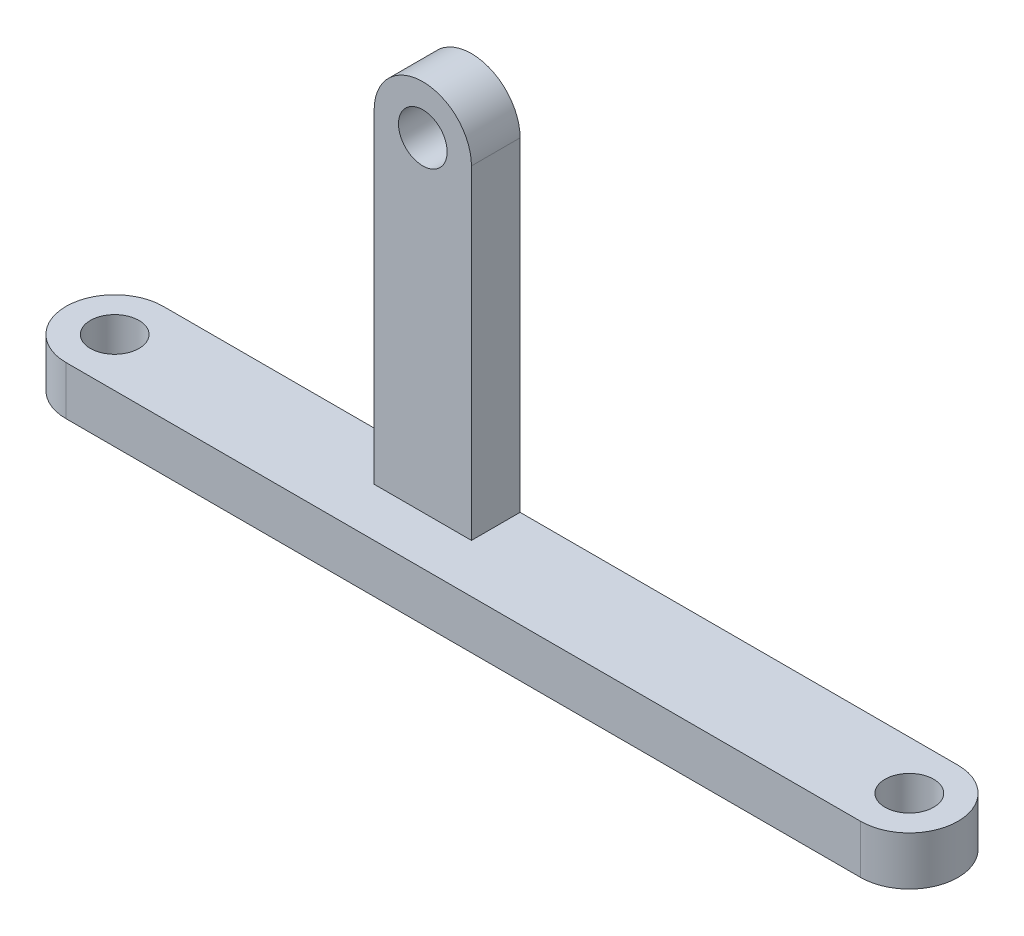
ISO-10303-21;
HEADER;
FILE_DESCRIPTION(('STEP AP214'),'2;1');
FILE_NAME('part.step','',(''),(''),'','','');
FILE_SCHEMA(('AUTOMOTIVE_DESIGN { 1 0 10303 214 1 1 1 1 }'));
ENDSEC;
DATA;
#1=APPLICATION_CONTEXT('core data for automotive mechanical design processes');
#2=APPLICATION_PROTOCOL_DEFINITION('international standard','automotive_design',2000,#1);
#3=PRODUCT_CONTEXT('',#1,'mechanical');
#4=PRODUCT('Part','Part','',(#3));
#5=PRODUCT_RELATED_PRODUCT_CATEGORY('part','',(#4));
#6=PRODUCT_DEFINITION_FORMATION('','',#4);
#7=PRODUCT_DEFINITION_CONTEXT('part definition',#1,'design');
#8=PRODUCT_DEFINITION('design','',#6,#7);
#9=PRODUCT_DEFINITION_SHAPE('','',#8);
#10=(LENGTH_UNIT() NAMED_UNIT(*) SI_UNIT(.MILLI.,.METRE.));
#11=(NAMED_UNIT(*) PLANE_ANGLE_UNIT() SI_UNIT($,.RADIAN.));
#12=(NAMED_UNIT(*) SI_UNIT($,.STERADIAN.) SOLID_ANGLE_UNIT());
#13=UNCERTAINTY_MEASURE_WITH_UNIT(LENGTH_MEASURE(1.E-05),#10,'distance_accuracy_value','');
#14=(GEOMETRIC_REPRESENTATION_CONTEXT(3) GLOBAL_UNCERTAINTY_ASSIGNED_CONTEXT((#13)) GLOBAL_UNIT_ASSIGNED_CONTEXT((#10,
#11,#12)) REPRESENTATION_CONTEXT('',''));
#15=CARTESIAN_POINT('',(0.,0.,0.));
#16=DIRECTION('',(0.,0.,1.));
#17=DIRECTION('',(1.,0.,0.));
#18=AXIS2_PLACEMENT_3D('',#15,#16,#17);
#19=CARTESIAN_POINT('',(-3.,0.,3.));
#20=DIRECTION('',(1.,0.,0.));
#21=DIRECTION('',(0.,1.,0.));
#22=AXIS2_PLACEMENT_3D('',#19,#20,#21);
#23=PLANE('',#22);
#24=DIRECTION('',(0.,-1.,0.));
#25=VECTOR('',#24,1.);
#26=CARTESIAN_POINT('',(-3.,0.,0.));
#27=LINE('',#26,#25);
#28=CARTESIAN_POINT('',(-3.,17.,0.));
#29=VERTEX_POINT('',#28);
#30=CARTESIAN_POINT('',(-3.,-3.,0.));
#31=VERTEX_POINT('',#30);
#32=EDGE_CURVE('E148',#29,#31,#27,.T.);
#33=ORIENTED_EDGE('',*,*,#32,.T.);
#34=DIRECTION('',(0.,0.,-1.));
#35=VECTOR('',#34,1.);
#36=CARTESIAN_POINT('',(-2.99999999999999,-3.,3.));
#37=LINE('',#36,#35);
#38=CARTESIAN_POINT('',(-2.99999999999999,-3.,3.));
#39=VERTEX_POINT('',#38);
#40=EDGE_CURVE('E11',#39,#31,#37,.T.);
#41=ORIENTED_EDGE('',*,*,#40,.F.);
#42=DIRECTION('',(0.,-1.,0.));
#43=VECTOR('',#42,1.);
#44=CARTESIAN_POINT('',(-3.,0.,3.));
#45=LINE('',#44,#43);
#46=CARTESIAN_POINT('',(-3.,17.,3.));
#47=VERTEX_POINT('',#46);
#48=EDGE_CURVE('E81',#47,#39,#45,.T.);
#49=ORIENTED_EDGE('',*,*,#48,.F.);
#50=DIRECTION('',(0.,0.,-1.));
#51=VECTOR('',#50,1.);
#52=CARTESIAN_POINT('',(-3.,17.,3.));
#53=LINE('',#52,#51);
#54=EDGE_CURVE('E168',#47,#29,#53,.T.);
#55=ORIENTED_EDGE('',*,*,#54,.T.);
#56=EDGE_LOOP('',(#33,#41,#49,#55));
#57=FACE_BOUND('',#56,.T.);
#58=ADVANCED_FACE('F41',(#57),#23,.F.);
#59=CARTESIAN_POINT('',(3.,0.,3.));
#60=DIRECTION('',(1.,0.,0.));
#61=DIRECTION('',(0.,1.,0.));
#62=AXIS2_PLACEMENT_3D('',#59,#60,#61);
#63=PLANE('',#62);
#64=DIRECTION('',(0.,-1.,0.));
#65=VECTOR('',#64,1.);
#66=CARTESIAN_POINT('',(3.,0.,0.));
#67=LINE('',#66,#65);
#68=CARTESIAN_POINT('',(3.,17.,0.));
#69=VERTEX_POINT('',#68);
#70=CARTESIAN_POINT('',(3.,-3.,0.));
#71=VERTEX_POINT('',#70);
#72=EDGE_CURVE('E172',#69,#71,#67,.T.);
#73=ORIENTED_EDGE('',*,*,#72,.F.);
#74=DIRECTION('',(0.,0.,-1.));
#75=VECTOR('',#74,1.);
#76=CARTESIAN_POINT('',(3.,17.,3.));
#77=LINE('',#76,#75);
#78=CARTESIAN_POINT('',(3.,17.,3.));
#79=VERTEX_POINT('',#78);
#80=EDGE_CURVE('E73',#79,#69,#77,.T.);
#81=ORIENTED_EDGE('',*,*,#80,.F.);
#82=DIRECTION('',(0.,-1.,0.));
#83=VECTOR('',#82,1.);
#84=CARTESIAN_POINT('',(3.,0.,3.));
#85=LINE('',#84,#83);
#86=CARTESIAN_POINT('',(3.,-3.,3.));
#87=VERTEX_POINT('',#86);
#88=EDGE_CURVE('E163',#79,#87,#85,.T.);
#89=ORIENTED_EDGE('',*,*,#88,.T.);
#90=DIRECTION('',(0.,0.,-1.));
#91=VECTOR('',#90,1.);
#92=CARTESIAN_POINT('',(3.,-3.,3.));
#93=LINE('',#92,#91);
#94=EDGE_CURVE('E51',#87,#71,#93,.T.);
#95=ORIENTED_EDGE('',*,*,#94,.T.);
#96=EDGE_LOOP('',(#73,#81,#89,#95));
#97=FACE_BOUND('',#96,.T.);
#98=ADVANCED_FACE('F185',(#97),#63,.T.);
#99=CARTESIAN_POINT('',(0.,17.,3.));
#100=DIRECTION('',(0.,0.,-1.));
#101=DIRECTION('',(-1.,0.,0.));
#102=AXIS2_PLACEMENT_3D('',#99,#100,#101);
#103=CYLINDRICAL_SURFACE('',#102,1.5);
#104=CARTESIAN_POINT('',(0.,17.,3.));
#105=DIRECTION('',(0.,0.,1.));
#106=DIRECTION('',(1.,0.,0.));
#107=AXIS2_PLACEMENT_3D('',#104,#105,#106);
#108=CIRCLE('',#107,1.5);
#109=CARTESIAN_POINT('',(1.5,17.,3.));
#110=VERTEX_POINT('',#109);
#111=EDGE_CURVE('E154',#110,#110,#108,.T.);
#112=ORIENTED_EDGE('',*,*,#111,.T.);
#113=EDGE_LOOP('',(#112));
#114=FACE_BOUND('',#113,.T.);
#115=CARTESIAN_POINT('',(0.,17.,0.));
#116=DIRECTION('',(0.,0.,1.));
#117=DIRECTION('',(1.,0.,0.));
#118=AXIS2_PLACEMENT_3D('',#115,#116,#117);
#119=CIRCLE('',#118,1.5);
#120=CARTESIAN_POINT('',(1.5,17.,0.));
#121=VERTEX_POINT('',#120);
#122=EDGE_CURVE('E143',#121,#121,#119,.T.);
#123=ORIENTED_EDGE('',*,*,#122,.F.);
#124=EDGE_LOOP('',(#123));
#125=FACE_BOUND('',#124,.T.);
#126=ADVANCED_FACE('F43',(#114,#125),#103,.F.);
#127=CARTESIAN_POINT('',(0.,17.,3.));
#128=DIRECTION('',(0.,0.,-1.));
#129=DIRECTION('',(-1.,0.,0.));
#130=AXIS2_PLACEMENT_3D('',#127,#128,#129);
#131=CYLINDRICAL_SURFACE('',#130,3.);
#132=CARTESIAN_POINT('',(0.,17.,0.));
#133=DIRECTION('',(0.,0.,1.));
#134=DIRECTION('',(1.,0.,0.));
#135=AXIS2_PLACEMENT_3D('',#132,#133,#134);
#136=CIRCLE('',#135,3.);
#137=EDGE_CURVE('E76',#69,#29,#136,.T.);
#138=ORIENTED_EDGE('',*,*,#137,.T.);
#139=ORIENTED_EDGE('',*,*,#54,.F.);
#140=CARTESIAN_POINT('',(0.,17.,3.));
#141=DIRECTION('',(0.,0.,1.));
#142=DIRECTION('',(1.,0.,0.));
#143=AXIS2_PLACEMENT_3D('',#140,#141,#142);
#144=CIRCLE('',#143,3.);
#145=EDGE_CURVE('E59',#79,#47,#144,.T.);
#146=ORIENTED_EDGE('',*,*,#145,.F.);
#147=ORIENTED_EDGE('',*,*,#80,.T.);
#148=EDGE_LOOP('',(#138,#139,#146,#147));
#149=FACE_BOUND('',#148,.T.);
#150=ADVANCED_FACE('F217',(#149),#131,.T.);
#151=CARTESIAN_POINT('',(0.,0.,3.));
#152=DIRECTION('',(0.,0.,1.));
#153=DIRECTION('',(1.,0.,0.));
#154=AXIS2_PLACEMENT_3D('',#151,#152,#153);
#155=PLANE('',#154);
#156=ORIENTED_EDGE('',*,*,#111,.F.);
#157=EDGE_LOOP('',(#156));
#158=FACE_BOUND('',#157,.T.);
#159=ORIENTED_EDGE('',*,*,#48,.T.);
#160=DIRECTION('',(1.,0.,0.));
#161=VECTOR('',#160,1.);
#162=CARTESIAN_POINT('',(0.,-3.,3.));
#163=LINE('',#162,#161);
#164=EDGE_CURVE('E160',#39,#87,#163,.T.);
#165=ORIENTED_EDGE('',*,*,#164,.T.);
#166=ORIENTED_EDGE('',*,*,#88,.F.);
#167=ORIENTED_EDGE('',*,*,#145,.T.);
#168=EDGE_LOOP('',(#159,#165,#166,#167));
#169=FACE_BOUND('',#168,.T.);
#170=ADVANCED_FACE('F218',(#158,#169),#155,.T.);
#171=CARTESIAN_POINT('',(0.,0.,0.));
#172=DIRECTION('',(0.,0.,1.));
#173=DIRECTION('',(1.,0.,0.));
#174=AXIS2_PLACEMENT_3D('',#171,#172,#173);
#175=PLANE('',#174);
#176=ORIENTED_EDGE('',*,*,#122,.T.);
#177=EDGE_LOOP('',(#176));
#178=FACE_BOUND('',#177,.T.);
#179=ORIENTED_EDGE('',*,*,#32,.F.);
#180=ORIENTED_EDGE('',*,*,#137,.F.);
#181=ORIENTED_EDGE('',*,*,#72,.T.);
#182=DIRECTION('',(1.,0.,0.));
#183=VECTOR('',#182,1.);
#184=CARTESIAN_POINT('',(-19.,-3.,0.));
#185=LINE('',#184,#183);
#186=CARTESIAN_POINT('',(30.,-2.99999999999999,0.));
#187=VERTEX_POINT('',#186);
#188=EDGE_CURVE('E189',#71,#187,#185,.T.);
#189=ORIENTED_EDGE('',*,*,#188,.T.);
#190=DIRECTION('',(0.,1.,0.));
#191=VECTOR('',#190,1.);
#192=CARTESIAN_POINT('',(30.,-5.99999999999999,0.));
#193=LINE('',#192,#191);
#194=CARTESIAN_POINT('',(30.,-5.99999999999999,0.));
#195=VERTEX_POINT('',#194);
#196=EDGE_CURVE('E121',#195,#187,#193,.T.);
#197=ORIENTED_EDGE('',*,*,#196,.F.);
#198=DIRECTION('',(1.,0.,0.));
#199=VECTOR('',#198,1.);
#200=CARTESIAN_POINT('',(-19.,-6.,0.));
#201=LINE('',#200,#199);
#202=CARTESIAN_POINT('',(-19.,-6.,0.));
#203=VERTEX_POINT('',#202);
#204=EDGE_CURVE('E112',#203,#195,#201,.T.);
#205=ORIENTED_EDGE('',*,*,#204,.F.);
#206=DIRECTION('',(0.,1.,0.));
#207=VECTOR('',#206,1.);
#208=CARTESIAN_POINT('',(-19.,-6.,0.));
#209=LINE('',#208,#207);
#210=CARTESIAN_POINT('',(-19.,-3.,0.));
#211=VERTEX_POINT('',#210);
#212=EDGE_CURVE('E118',#203,#211,#209,.T.);
#213=ORIENTED_EDGE('',*,*,#212,.T.);
#214=EDGE_CURVE('E196',#211,#31,#185,.T.);
#215=ORIENTED_EDGE('',*,*,#214,.T.);
#216=EDGE_LOOP('',(#179,#180,#181,#189,#197,#205,#213,#215));
#217=FACE_BOUND('',#216,.T.);
#218=ADVANCED_FACE('F115',(#178,#217),#175,.F.);
#219=CARTESIAN_POINT('',(-19.,-6.,3.));
#220=DIRECTION('',(0.,-1.,0.));
#221=DIRECTION('',(1.,0.,0.));
#222=AXIS2_PLACEMENT_3D('',#219,#220,#221);
#223=PLANE('',#222);
#224=CARTESIAN_POINT('',(-19.,-6.,3.));
#225=DIRECTION('',(0.,-1.,0.));
#226=DIRECTION('',(1.,0.,0.));
#227=AXIS2_PLACEMENT_3D('',#224,#225,#226);
#228=CIRCLE('',#227,1.5);
#229=CARTESIAN_POINT('',(-17.5,-6.,3.));
#230=VERTEX_POINT('',#229);
#231=EDGE_CURVE('E200',#230,#230,#228,.T.);
#232=ORIENTED_EDGE('',*,*,#231,.F.);
#233=EDGE_LOOP('',(#232));
#234=FACE_BOUND('',#233,.T.);
#235=CARTESIAN_POINT('',(-19.,-6.,3.));
#236=DIRECTION('',(0.,-1.,0.));
#237=DIRECTION('',(1.,0.,0.));
#238=AXIS2_PLACEMENT_3D('',#235,#236,#237);
#239=CIRCLE('',#238,3.);
#240=CARTESIAN_POINT('',(-19.,-6.,6.));
#241=VERTEX_POINT('',#240);
#242=EDGE_CURVE('E126',#241,#203,#239,.T.);
#243=ORIENTED_EDGE('',*,*,#242,.T.);
#244=ORIENTED_EDGE('',*,*,#204,.T.);
#245=CARTESIAN_POINT('',(30.,-5.99999999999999,3.00000000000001));
#246=DIRECTION('',(0.,-1.,0.));
#247=DIRECTION('',(1.,0.,0.));
#248=AXIS2_PLACEMENT_3D('',#245,#246,#247);
#249=CIRCLE('',#248,3.);
#250=CARTESIAN_POINT('',(30.,-5.99999999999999,6.00000000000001));
#251=VERTEX_POINT('',#250);
#252=EDGE_CURVE('E125',#195,#251,#249,.T.);
#253=ORIENTED_EDGE('',*,*,#252,.T.);
#254=DIRECTION('',(-1.,0.,0.));
#255=VECTOR('',#254,1.);
#256=CARTESIAN_POINT('',(-19.,-6.,6.));
#257=LINE('',#256,#255);
#258=EDGE_CURVE('E132',#251,#241,#257,.T.);
#259=ORIENTED_EDGE('',*,*,#258,.T.);
#260=EDGE_LOOP('',(#243,#244,#253,#259));
#261=FACE_BOUND('',#260,.T.);
#262=CARTESIAN_POINT('',(30.,-5.99999999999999,3.00000000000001));
#263=DIRECTION('',(0.,-1.,0.));
#264=DIRECTION('',(1.,0.,0.));
#265=AXIS2_PLACEMENT_3D('',#262,#263,#264);
#266=CIRCLE('',#265,1.5);
#267=CARTESIAN_POINT('',(31.5,-5.99999999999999,3.00000000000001));
#268=VERTEX_POINT('',#267);
#269=EDGE_CURVE('E340',#268,#268,#266,.T.);
#270=ORIENTED_EDGE('',*,*,#269,.F.);
#271=EDGE_LOOP('',(#270));
#272=FACE_BOUND('',#271,.T.);
#273=ADVANCED_FACE('F129',(#234,#261,#272),#223,.T.);
#274=CARTESIAN_POINT('',(-19.,-3.,3.));
#275=DIRECTION('',(0.,-1.,0.));
#276=DIRECTION('',(1.,0.,0.));
#277=AXIS2_PLACEMENT_3D('',#274,#275,#276);
#278=PLANE('',#277);
#279=ORIENTED_EDGE('',*,*,#94,.F.);
#280=ORIENTED_EDGE('',*,*,#164,.F.);
#281=ORIENTED_EDGE('',*,*,#40,.T.);
#282=ORIENTED_EDGE('',*,*,#214,.F.);
#283=CARTESIAN_POINT('',(-19.,-3.,3.));
#284=DIRECTION('',(0.,-1.,0.));
#285=DIRECTION('',(1.,0.,0.));
#286=AXIS2_PLACEMENT_3D('',#283,#284,#285);
#287=CIRCLE('',#286,3.);
#288=CARTESIAN_POINT('',(-19.,-3.,6.));
#289=VERTEX_POINT('',#288);
#290=EDGE_CURVE('E141',#289,#211,#287,.T.);
#291=ORIENTED_EDGE('',*,*,#290,.F.);
#292=DIRECTION('',(-1.,0.,0.));
#293=VECTOR('',#292,1.);
#294=CARTESIAN_POINT('',(-19.,-3.,6.));
#295=LINE('',#294,#293);
#296=CARTESIAN_POINT('',(30.,-2.99999999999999,6.00000000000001));
#297=VERTEX_POINT('',#296);
#298=EDGE_CURVE('E137',#297,#289,#295,.T.);
#299=ORIENTED_EDGE('',*,*,#298,.F.);
#300=CARTESIAN_POINT('',(30.,-2.99999999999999,3.00000000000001));
#301=DIRECTION('',(0.,-1.,0.));
#302=DIRECTION('',(1.,0.,0.));
#303=AXIS2_PLACEMENT_3D('',#300,#301,#302);
#304=CIRCLE('',#303,3.);
#305=EDGE_CURVE('E194',#187,#297,#304,.T.);
#306=ORIENTED_EDGE('',*,*,#305,.F.);
#307=ORIENTED_EDGE('',*,*,#188,.F.);
#308=EDGE_LOOP('',(#279,#280,#281,#282,#291,#299,#306,#307));
#309=FACE_BOUND('',#308,.T.);
#310=CARTESIAN_POINT('',(-19.,-3.,3.));
#311=DIRECTION('',(0.,-1.,0.));
#312=DIRECTION('',(1.,0.,0.));
#313=AXIS2_PLACEMENT_3D('',#310,#311,#312);
#314=CIRCLE('',#313,1.5);
#315=CARTESIAN_POINT('',(-17.5,-3.,3.));
#316=VERTEX_POINT('',#315);
#317=EDGE_CURVE('E348',#316,#316,#314,.T.);
#318=ORIENTED_EDGE('',*,*,#317,.T.);
#319=EDGE_LOOP('',(#318));
#320=FACE_BOUND('',#319,.T.);
#321=CARTESIAN_POINT('',(30.,-2.99999999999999,3.00000000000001));
#322=DIRECTION('',(0.,-1.,0.));
#323=DIRECTION('',(1.,0.,0.));
#324=AXIS2_PLACEMENT_3D('',#321,#322,#323);
#325=CIRCLE('',#324,1.5);
#326=CARTESIAN_POINT('',(31.5,-2.99999999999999,3.00000000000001));
#327=VERTEX_POINT('',#326);
#328=EDGE_CURVE('E343',#327,#327,#325,.T.);
#329=ORIENTED_EDGE('',*,*,#328,.T.);
#330=EDGE_LOOP('',(#329));
#331=FACE_BOUND('',#330,.T.);
#332=ADVANCED_FACE('F191',(#309,#320,#331),#278,.F.);
#333=CARTESIAN_POINT('',(-19.,-6.,3.));
#334=DIRECTION('',(0.,1.,0.));
#335=DIRECTION('',(-1.,0.,0.));
#336=AXIS2_PLACEMENT_3D('',#333,#334,#335);
#337=CYLINDRICAL_SURFACE('',#336,3.);
#338=ORIENTED_EDGE('',*,*,#290,.T.);
#339=ORIENTED_EDGE('',*,*,#212,.F.);
#340=ORIENTED_EDGE('',*,*,#242,.F.);
#341=DIRECTION('',(0.,1.,0.));
#342=VECTOR('',#341,1.);
#343=CARTESIAN_POINT('',(-19.,-6.,6.));
#344=LINE('',#343,#342);
#345=EDGE_CURVE('E208',#241,#289,#344,.T.);
#346=ORIENTED_EDGE('',*,*,#345,.T.);
#347=EDGE_LOOP('',(#338,#339,#340,#346));
#348=FACE_BOUND('',#347,.T.);
#349=ADVANCED_FACE('F139',(#348),#337,.T.);
#350=CARTESIAN_POINT('',(30.,-5.99999999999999,3.00000000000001));
#351=DIRECTION('',(0.,1.,0.));
#352=DIRECTION('',(-1.,0.,0.));
#353=AXIS2_PLACEMENT_3D('',#350,#351,#352);
#354=CYLINDRICAL_SURFACE('',#353,3.);
#355=ORIENTED_EDGE('',*,*,#305,.T.);
#356=DIRECTION('',(0.,1.,0.));
#357=VECTOR('',#356,1.);
#358=CARTESIAN_POINT('',(30.,-5.99999999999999,6.00000000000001));
#359=LINE('',#358,#357);
#360=EDGE_CURVE('E150',#251,#297,#359,.T.);
#361=ORIENTED_EDGE('',*,*,#360,.F.);
#362=ORIENTED_EDGE('',*,*,#252,.F.);
#363=ORIENTED_EDGE('',*,*,#196,.T.);
#364=EDGE_LOOP('',(#355,#361,#362,#363));
#365=FACE_BOUND('',#364,.T.);
#366=ADVANCED_FACE('F298',(#365),#354,.T.);
#367=CARTESIAN_POINT('',(-19.,-6.,6.));
#368=DIRECTION('',(0.,0.,-1.));
#369=DIRECTION('',(-1.,0.,0.));
#370=AXIS2_PLACEMENT_3D('',#367,#368,#369);
#371=PLANE('',#370);
#372=ORIENTED_EDGE('',*,*,#298,.T.);
#373=ORIENTED_EDGE('',*,*,#345,.F.);
#374=ORIENTED_EDGE('',*,*,#258,.F.);
#375=ORIENTED_EDGE('',*,*,#360,.T.);
#376=EDGE_LOOP('',(#372,#373,#374,#375));
#377=FACE_BOUND('',#376,.T.);
#378=ADVANCED_FACE('F214',(#377),#371,.F.);
#379=CARTESIAN_POINT('',(-19.,-6.,3.));
#380=DIRECTION('',(0.,1.,0.));
#381=DIRECTION('',(-1.,0.,0.));
#382=AXIS2_PLACEMENT_3D('',#379,#380,#381);
#383=CYLINDRICAL_SURFACE('',#382,1.5);
#384=ORIENTED_EDGE('',*,*,#231,.T.);
#385=EDGE_LOOP('',(#384));
#386=FACE_BOUND('',#385,.T.);
#387=ORIENTED_EDGE('',*,*,#317,.F.);
#388=EDGE_LOOP('',(#387));
#389=FACE_BOUND('',#388,.T.);
#390=ADVANCED_FACE('F314',(#386,#389),#383,.F.);
#391=CARTESIAN_POINT('',(30.,-5.99999999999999,3.00000000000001));
#392=DIRECTION('',(0.,1.,0.));
#393=DIRECTION('',(-1.,0.,0.));
#394=AXIS2_PLACEMENT_3D('',#391,#392,#393);
#395=CYLINDRICAL_SURFACE('',#394,1.5);
#396=ORIENTED_EDGE('',*,*,#269,.T.);
#397=EDGE_LOOP('',(#396));
#398=FACE_BOUND('',#397,.T.);
#399=ORIENTED_EDGE('',*,*,#328,.F.);
#400=EDGE_LOOP('',(#399));
#401=FACE_BOUND('',#400,.T.);
#402=ADVANCED_FACE('F323',(#398,#401),#395,.F.);
#403=CLOSED_SHELL('',(#58,#98,#126,#150,#170,#218,#273,#332,#349,#366,#378,#390,#402));
#404=MANIFOLD_SOLID_BREP('B2',#403);
#405=ADVANCED_BREP_SHAPE_REPRESENTATION('',(#18,#404),#14);
#406=SHAPE_DEFINITION_REPRESENTATION(#9,#405);
ENDSEC;
END-ISO-10303-21;
